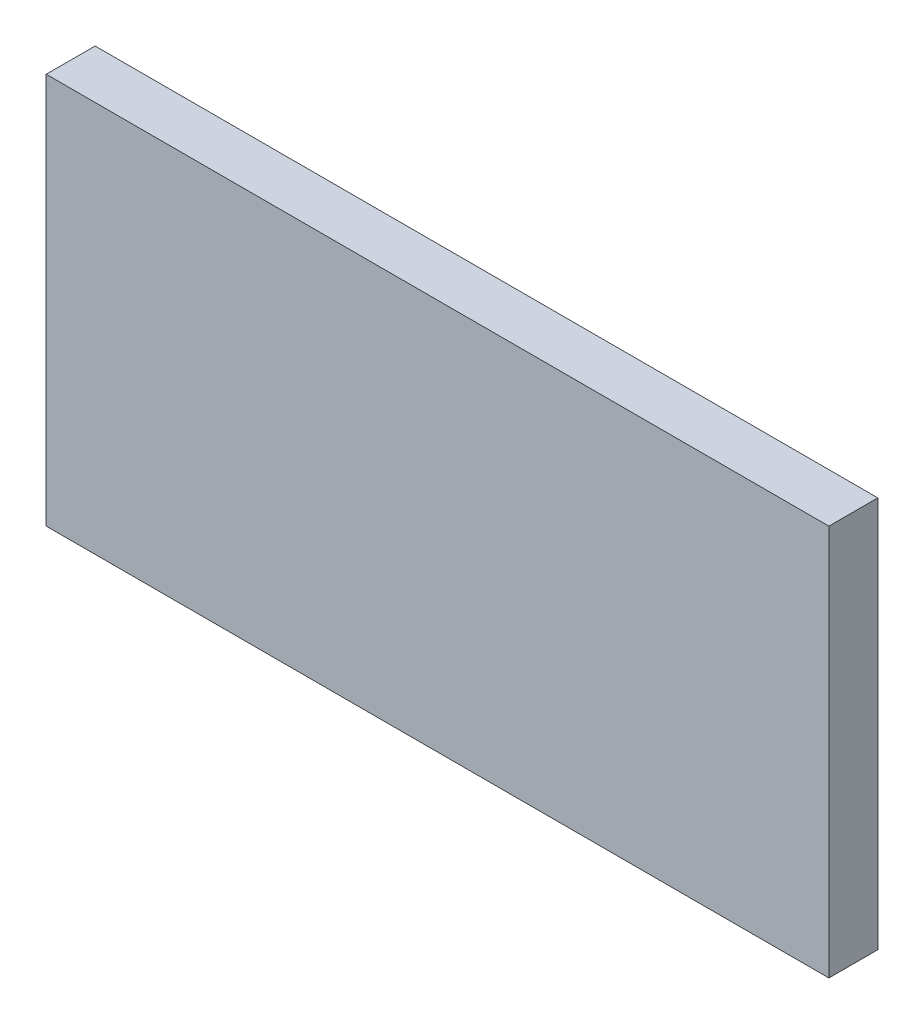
from build123d import *

# Parameters (mm, degrees)
SZKIC1_W                      = 800
SZKIC1_H                      = 400
DODANIE_WYCI_GNI_CIE1_DEPTH   = 50
DODANIE_WYCI_GNI_CIE2_START   = 20
SZKIC3_R                      = 20
DODANIE_WYCI_GNI_CIE2_DEPTH   = 20
SZYK_LINIOWY1_COUNT           = 2
SZYK_LINIOWY1_PITCH           = 400
SZYK_START                    = 20
SZYK_LINIOWY1_COPY_1_SKETCH_R = 20
SZYK_LINIOWY1_COPY_1_DEPTH    = 20


with BuildPart() as part:
    # Szkic1 → Dodanie-wyci_gni_cie1 (new body)
    with BuildSketch(Plane.XY):
        Rectangle(SZKIC1_W, SZKIC1_H)
    extrude(amount=DODANIE_WYCI_GNI_CIE1_DEPTH)

    # Szkic3 → Dodanie-wyci_gni_cie2 (add)
    with BuildSketch(Plane(origin=(0, 0, 0), x_dir=(1, 0, 0), z_dir=(0, 1, 0)).offset(DODANIE_WYCI_GNI_CIE2_START)):
        with BuildLine():
            Line((-300, 0), (-300, 60))
            ThreePointArc((-300, 60), (-270, 90), (-240, 60))
            Line((-240, 60), (-240, 0))
            Line((-240, 0), (-300, 0))
        make_face()
        with Locations(Location((-270, 60, 0), (0, 0, 270))):
            Circle(SZKIC3_R, mode=Mode.SUBTRACT)
    dodanie_wyci_gni_cie2 = extrude(amount=DODANIE_WYCI_GNI_CIE2_DEPTH)

    # Lustro1: Dodanie-wyci_gni_cie2 across plane
    add(dodanie_wyci_gni_cie2.mirror(Plane.ZX))

    # Szyk liniowy1: Dodanie-wyci_gni_cie2 ×2
    with Locations(*[(i * SZYK_LINIOWY1_PITCH, 0, 0) for i in range(1, SZYK_LINIOWY1_COUNT)]):
        add(dodanie_wyci_gni_cie2)

    # Szyk liniowy1 copy 1 sketch → Szyk liniowy1 copy 1 (add)
    with BuildSketch(Plane(origin=(400, 0, 0), x_dir=(1, 0, 0), z_dir=(0, -1, 0)).offset(SZYK_START)):
        with BuildLine():
            Line((-300, 0), (-300, -60))
            ThreePointArc((-300, -60), (-270, -90), (-240, -60))
            Line((-240, -60), (-240, 0))
            Line((-240, 0), (-300, 0))
        make_face()
        with Locations((-270, -60)):
            Circle(SZYK_LINIOWY1_COPY_1_SKETCH_R, mode=Mode.SUBTRACT)
    extrude(amount=SZYK_LINIOWY1_COPY_1_DEPTH)


solid = part.part
